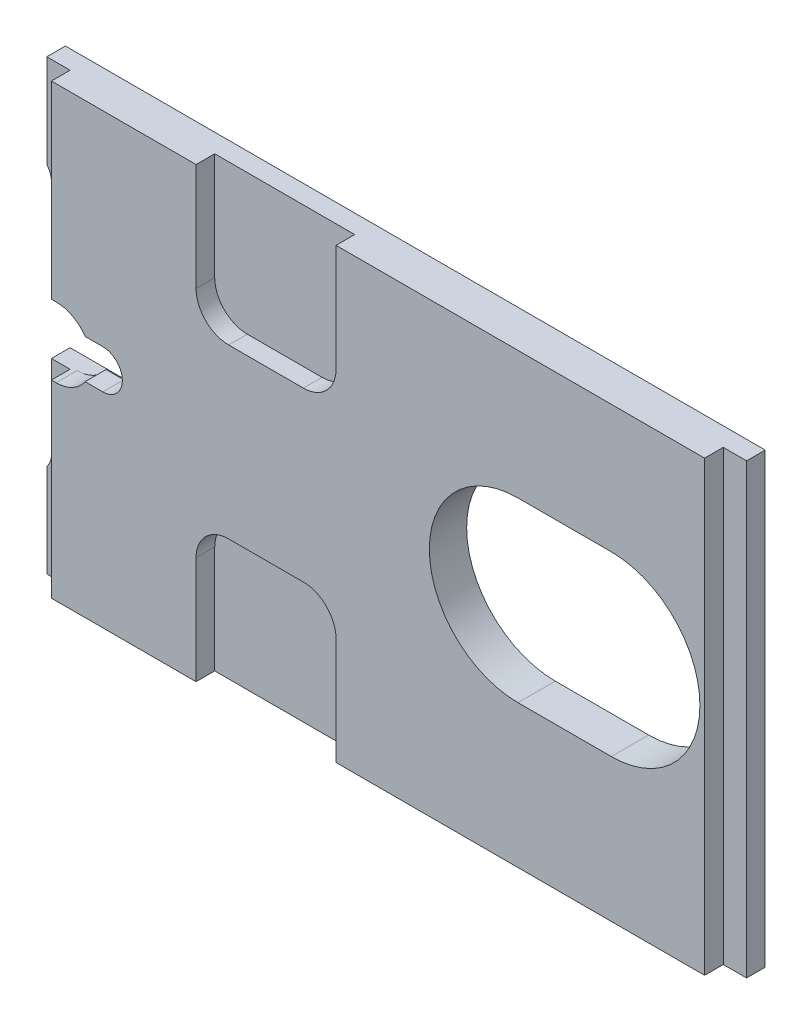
ISO-10303-21;
HEADER;
FILE_DESCRIPTION(('STEP AP214'),'2;1');
FILE_NAME('part.step','',(''),(''),'','','');
FILE_SCHEMA(('AUTOMOTIVE_DESIGN { 1 0 10303 214 1 1 1 1 }'));
ENDSEC;
DATA;
#1=APPLICATION_CONTEXT('core data for automotive mechanical design processes');
#2=APPLICATION_PROTOCOL_DEFINITION('international standard','automotive_design',2000,#1);
#3=PRODUCT_CONTEXT('',#1,'mechanical');
#4=PRODUCT('Part','Part','',(#3));
#5=PRODUCT_RELATED_PRODUCT_CATEGORY('part','',(#4));
#6=PRODUCT_DEFINITION_FORMATION('','',#4);
#7=PRODUCT_DEFINITION_CONTEXT('part definition',#1,'design');
#8=PRODUCT_DEFINITION('design','',#6,#7);
#9=PRODUCT_DEFINITION_SHAPE('','',#8);
#10=(LENGTH_UNIT() NAMED_UNIT(*) SI_UNIT(.MILLI.,.METRE.));
#11=(NAMED_UNIT(*) PLANE_ANGLE_UNIT() SI_UNIT($,.RADIAN.));
#12=(NAMED_UNIT(*) SI_UNIT($,.STERADIAN.) SOLID_ANGLE_UNIT());
#13=UNCERTAINTY_MEASURE_WITH_UNIT(LENGTH_MEASURE(1.E-05),#10,'distance_accuracy_value','');
#14=(GEOMETRIC_REPRESENTATION_CONTEXT(3) GLOBAL_UNCERTAINTY_ASSIGNED_CONTEXT((#13)) GLOBAL_UNIT_ASSIGNED_CONTEXT((#10,
#11,#12)) REPRESENTATION_CONTEXT('',''));
#15=CARTESIAN_POINT('',(0.,0.,0.));
#16=DIRECTION('',(0.,0.,1.));
#17=DIRECTION('',(1.,0.,0.));
#18=AXIS2_PLACEMENT_3D('',#15,#16,#17);
#19=CARTESIAN_POINT('',(-19.,25.354248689,0.));
#20=DIRECTION('',(0.,0.,1.));
#21=DIRECTION('',(1.,0.,0.));
#22=AXIS2_PLACEMENT_3D('',#19,#20,#21);
#23=CYLINDRICAL_SURFACE('',#22,4.);
#24=DIRECTION('',(0.,0.,1.));
#25=VECTOR('',#24,1.);
#26=CARTESIAN_POINT('',(-15.,25.354248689,2.));
#27=LINE('',#26,#25);
#28=CARTESIAN_POINT('',(-14.999999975,25.354248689,0.));
#29=VERTEX_POINT('',#28);
#30=CARTESIAN_POINT('',(-15.,25.354248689,4.));
#31=VERTEX_POINT('',#30);
#32=EDGE_CURVE('E576',#29,#31,#27,.T.);
#33=ORIENTED_EDGE('',*,*,#32,.T.);
#34=CARTESIAN_POINT('',(-19.,25.354248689,4.));
#35=DIRECTION('',(0.,0.,1.));
#36=DIRECTION('',(1.,0.,0.));
#37=AXIS2_PLACEMENT_3D('',#34,#35,#36);
#38=CIRCLE('',#37,4.);
#39=CARTESIAN_POINT('',(-16.,28.0000000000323,4.));
#40=VERTEX_POINT('',#39);
#41=EDGE_CURVE('E332',#31,#40,#38,.T.);
#42=ORIENTED_EDGE('',*,*,#41,.T.);
#43=DIRECTION('',(0.,0.,-1.));
#44=VECTOR('',#43,1.);
#45=CARTESIAN_POINT('',(-16.,28.,2.));
#46=LINE('',#45,#44);
#47=CARTESIAN_POINT('',(-16.,28.0000000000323,0.));
#48=VERTEX_POINT('',#47);
#49=EDGE_CURVE('E319',#40,#48,#46,.T.);
#50=ORIENTED_EDGE('',*,*,#49,.T.);
#51=CARTESIAN_POINT('',(-19.,25.354248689,0.));
#52=DIRECTION('',(0.,0.,1.));
#53=DIRECTION('',(1.,0.,0.));
#54=AXIS2_PLACEMENT_3D('',#51,#52,#53);
#55=CIRCLE('',#54,4.);
#56=EDGE_CURVE('E331',#29,#48,#55,.T.);
#57=ORIENTED_EDGE('',*,*,#56,.F.);
#58=EDGE_LOOP('',(#33,#42,#50,#57));
#59=FACE_BOUND('',#58,.T.);
#60=ADVANCED_FACE('F14',(#59),#23,.F.);
#61=CARTESIAN_POINT('',(-19.,-25.354248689,0.));
#62=DIRECTION('',(0.,0.,1.));
#63=DIRECTION('',(1.,0.,0.));
#64=AXIS2_PLACEMENT_3D('',#61,#62,#63);
#65=CYLINDRICAL_SURFACE('',#64,4.);
#66=DIRECTION('',(0.,0.,1.));
#67=VECTOR('',#66,1.);
#68=CARTESIAN_POINT('',(-16.,-28.,2.));
#69=LINE('',#68,#67);
#70=CARTESIAN_POINT('',(-16.,-28.0000000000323,0.));
#71=VERTEX_POINT('',#70);
#72=CARTESIAN_POINT('',(-16.,-28.0000000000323,4.));
#73=VERTEX_POINT('',#72);
#74=EDGE_CURVE('E326',#71,#73,#69,.T.);
#75=ORIENTED_EDGE('',*,*,#74,.T.);
#76=CARTESIAN_POINT('',(-19.,-25.354248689,4.));
#77=DIRECTION('',(0.,0.,1.));
#78=DIRECTION('',(1.,0.,0.));
#79=AXIS2_PLACEMENT_3D('',#76,#77,#78);
#80=CIRCLE('',#79,4.);
#81=CARTESIAN_POINT('',(-15.,-25.354248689,4.));
#82=VERTEX_POINT('',#81);
#83=EDGE_CURVE('E320',#73,#82,#80,.T.);
#84=ORIENTED_EDGE('',*,*,#83,.T.);
#85=DIRECTION('',(0.,0.,-1.));
#86=VECTOR('',#85,1.);
#87=CARTESIAN_POINT('',(-15.,-25.354248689,2.));
#88=LINE('',#87,#86);
#89=CARTESIAN_POINT('',(-14.999999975,-25.354248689,0.));
#90=VERTEX_POINT('',#89);
#91=EDGE_CURVE('E316',#82,#90,#88,.T.);
#92=ORIENTED_EDGE('',*,*,#91,.T.);
#93=CARTESIAN_POINT('',(-19.,-25.354248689,0.));
#94=DIRECTION('',(0.,0.,1.));
#95=DIRECTION('',(1.,0.,0.));
#96=AXIS2_PLACEMENT_3D('',#93,#94,#95);
#97=CIRCLE('',#96,4.);
#98=EDGE_CURVE('E349',#71,#90,#97,.T.);
#99=ORIENTED_EDGE('',*,*,#98,.F.);
#100=EDGE_LOOP('',(#75,#84,#92,#99));
#101=FACE_BOUND('',#100,.T.);
#102=ADVANCED_FACE('F841',(#101),#65,.F.);
#103=CARTESIAN_POINT('',(-15.,-7.5,4.));
#104=DIRECTION('',(1.,0.,0.));
#105=DIRECTION('',(0.,-1.,0.));
#106=AXIS2_PLACEMENT_3D('',#103,#104,#105);
#107=PLANE('',#106);
#108=ORIENTED_EDGE('',*,*,#91,.F.);
#109=DIRECTION('',(0.,1.,0.));
#110=VECTOR('',#109,1.);
#111=CARTESIAN_POINT('',(-15.,-27.75,4.));
#112=LINE('',#111,#110);
#113=CARTESIAN_POINT('',(-15.,-7.5,4.));
#114=VERTEX_POINT('',#113);
#115=EDGE_CURVE('E317',#82,#114,#112,.T.);
#116=ORIENTED_EDGE('',*,*,#115,.T.);
#117=DIRECTION('',(0.,0.,-1.));
#118=VECTOR('',#117,1.);
#119=CARTESIAN_POINT('',(-15.,-7.5,4.));
#120=LINE('',#119,#118);
#121=CARTESIAN_POINT('',(-14.9999999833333,-7.5,0.));
#122=VERTEX_POINT('',#121);
#123=EDGE_CURVE('E552',#114,#122,#120,.T.);
#124=ORIENTED_EDGE('',*,*,#123,.T.);
#125=DIRECTION('',(0.,1.,0.));
#126=VECTOR('',#125,1.);
#127=CARTESIAN_POINT('',(-14.99999995,0.,0.));
#128=LINE('',#127,#126);
#129=EDGE_CURVE('E344',#90,#122,#128,.T.);
#130=ORIENTED_EDGE('',*,*,#129,.F.);
#131=EDGE_LOOP('',(#108,#116,#124,#130));
#132=FACE_BOUND('',#131,.T.);
#133=ADVANCED_FACE('F838',(#132),#107,.F.);
#134=CARTESIAN_POINT('',(-15.,25.354248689,4.));
#135=DIRECTION('',(1.,0.,0.));
#136=DIRECTION('',(0.,-1.,0.));
#137=AXIS2_PLACEMENT_3D('',#134,#135,#136);
#138=PLANE('',#137);
#139=ORIENTED_EDGE('',*,*,#32,.F.);
#140=DIRECTION('',(0.,1.,0.));
#141=VECTOR('',#140,1.);
#142=CARTESIAN_POINT('',(-14.99999995,0.,0.));
#143=LINE('',#142,#141);
#144=CARTESIAN_POINT('',(-14.9999999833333,7.5,0.));
#145=VERTEX_POINT('',#144);
#146=EDGE_CURVE('E340',#145,#29,#143,.T.);
#147=ORIENTED_EDGE('',*,*,#146,.F.);
#148=DIRECTION('',(0.,0.,1.));
#149=VECTOR('',#148,1.);
#150=CARTESIAN_POINT('',(-15.,7.5,4.));
#151=LINE('',#150,#149);
#152=CARTESIAN_POINT('',(-15.,7.5,4.));
#153=VERTEX_POINT('',#152);
#154=EDGE_CURVE('E526',#145,#153,#151,.T.);
#155=ORIENTED_EDGE('',*,*,#154,.T.);
#156=DIRECTION('',(0.,1.,0.));
#157=VECTOR('',#156,1.);
#158=CARTESIAN_POINT('',(-15.,27.75,4.));
#159=LINE('',#158,#157);
#160=EDGE_CURVE('E335',#153,#31,#159,.T.);
#161=ORIENTED_EDGE('',*,*,#160,.T.);
#162=EDGE_LOOP('',(#139,#147,#155,#161));
#163=FACE_BOUND('',#162,.T.);
#164=ADVANCED_FACE('F745',(#163),#138,.F.);
#165=CARTESIAN_POINT('',(-16.,-48.,4.));
#166=DIRECTION('',(1.,0.,0.));
#167=DIRECTION('',(0.,0.,-1.));
#168=AXIS2_PLACEMENT_3D('',#165,#166,#167);
#169=PLANE('',#168);
#170=ORIENTED_EDGE('',*,*,#74,.F.);
#171=DIRECTION('',(0.,1.,0.));
#172=VECTOR('',#171,1.);
#173=CARTESIAN_POINT('',(-16.,0.,0.));
#174=LINE('',#173,#172);
#175=CARTESIAN_POINT('',(-16.,-48.,0.));
#176=VERTEX_POINT('',#175);
#177=EDGE_CURVE('E352',#176,#71,#174,.T.);
#178=ORIENTED_EDGE('',*,*,#177,.F.);
#179=DIRECTION('',(0.,0.,1.));
#180=VECTOR('',#179,1.);
#181=CARTESIAN_POINT('',(-16.,-48.,4.));
#182=LINE('',#181,#180);
#183=CARTESIAN_POINT('',(-16.,-48.,4.));
#184=VERTEX_POINT('',#183);
#185=EDGE_CURVE('E582',#176,#184,#182,.T.);
#186=ORIENTED_EDGE('',*,*,#185,.T.);
#187=DIRECTION('',(0.,1.,0.));
#188=VECTOR('',#187,1.);
#189=CARTESIAN_POINT('',(-16.,-27.75,4.));
#190=LINE('',#189,#188);
#191=EDGE_CURVE('E323',#184,#73,#190,.T.);
#192=ORIENTED_EDGE('',*,*,#191,.T.);
#193=EDGE_LOOP('',(#170,#178,#186,#192));
#194=FACE_BOUND('',#193,.T.);
#195=ADVANCED_FACE('F845',(#194),#169,.F.);
#196=CARTESIAN_POINT('',(20.,-48.,4.));
#197=DIRECTION('',(0.,0.,-1.));
#198=DIRECTION('',(0.,1.,0.));
#199=AXIS2_PLACEMENT_3D('',#196,#197,#198);
#200=PLANE('',#199);
#201=DIRECTION('',(0.,1.,0.));
#202=VECTOR('',#201,1.);
#203=CARTESIAN_POINT('',(50.,-36.5,4.));
#204=LINE('',#203,#202);
#205=CARTESIAN_POINT('',(49.9999999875,-48.,4.));
#206=VERTEX_POINT('',#205);
#207=CARTESIAN_POINT('',(50.,-24.9999999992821,4.));
#208=VERTEX_POINT('',#207);
#209=EDGE_CURVE('E519',#206,#208,#204,.T.);
#210=ORIENTED_EDGE('',*,*,#209,.T.);
#211=CARTESIAN_POINT('',(43.,-25.,4.));
#212=DIRECTION('',(0.,0.,1.));
#213=DIRECTION('',(1.,0.,0.));
#214=AXIS2_PLACEMENT_3D('',#211,#212,#213);
#215=CIRCLE('',#214,7.);
#216=CARTESIAN_POINT('',(43.,-18.,4.));
#217=VERTEX_POINT('',#216);
#218=EDGE_CURVE('E494',#217,#208,#215,.F.);
#219=ORIENTED_EDGE('',*,*,#218,.F.);
#220=DIRECTION('',(-1.,0.,0.));
#221=VECTOR('',#220,1.);
#222=CARTESIAN_POINT('',(35.,-18.,4.));
#223=LINE('',#222,#221);
#224=CARTESIAN_POINT('',(26.9999999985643,-18.,4.));
#225=VERTEX_POINT('',#224);
#226=EDGE_CURVE('E490',#217,#225,#223,.T.);
#227=ORIENTED_EDGE('',*,*,#226,.T.);
#228=CARTESIAN_POINT('',(27.,-25.,4.));
#229=DIRECTION('',(0.,0.,1.));
#230=DIRECTION('',(1.,0.,0.));
#231=AXIS2_PLACEMENT_3D('',#228,#229,#230);
#232=CIRCLE('',#231,7.);
#233=CARTESIAN_POINT('',(20.,-25.,4.));
#234=VERTEX_POINT('',#233);
#235=EDGE_CURVE('E486',#234,#225,#232,.F.);
#236=ORIENTED_EDGE('',*,*,#235,.F.);
#237=DIRECTION('',(0.,-1.,0.));
#238=VECTOR('',#237,1.);
#239=CARTESIAN_POINT('',(20.,-36.5,4.));
#240=LINE('',#239,#238);
#241=CARTESIAN_POINT('',(20.000000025,-48.,4.));
#242=VERTEX_POINT('',#241);
#243=EDGE_CURVE('E471',#234,#242,#240,.T.);
#244=ORIENTED_EDGE('',*,*,#243,.T.);
#245=DIRECTION('',(1.,0.,0.));
#246=VECTOR('',#245,1.);
#247=CARTESIAN_POINT('',(71.5,-48.,4.));
#248=LINE('',#247,#246);
#249=EDGE_CURVE('E476',#242,#206,#248,.T.);
#250=ORIENTED_EDGE('',*,*,#249,.T.);
#251=EDGE_LOOP('',(#210,#219,#227,#236,#244,#250));
#252=FACE_BOUND('',#251,.T.);
#253=ADVANCED_FACE('F848',(#252),#200,.F.);
#254=CARTESIAN_POINT('',(-16.,-48.,4.));
#255=DIRECTION('',(0.,0.,-1.));
#256=DIRECTION('',(0.,1.,0.));
#257=AXIS2_PLACEMENT_3D('',#254,#255,#256);
#258=PLANE('',#257);
#259=ORIENTED_EDGE('',*,*,#115,.F.);
#260=ORIENTED_EDGE('',*,*,#83,.F.);
#261=ORIENTED_EDGE('',*,*,#191,.F.);
#262=DIRECTION('',(1.,0.,0.));
#263=VECTOR('',#262,1.);
#264=CARTESIAN_POINT('',(71.5,-48.,4.));
#265=LINE('',#264,#263);
#266=CARTESIAN_POINT('',(-10.9999999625,-48.,4.));
#267=VERTEX_POINT('',#266);
#268=EDGE_CURVE('E477',#184,#267,#265,.T.);
#269=ORIENTED_EDGE('',*,*,#268,.T.);
#270=DIRECTION('',(0.,1.,0.));
#271=VECTOR('',#270,1.);
#272=CARTESIAN_POINT('',(-11.,-27.75,4.));
#273=LINE('',#272,#271);
#274=CARTESIAN_POINT('',(-10.9999999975,-7.5,4.));
#275=VERTEX_POINT('',#274);
#276=EDGE_CURVE('E365',#267,#275,#273,.T.);
#277=ORIENTED_EDGE('',*,*,#276,.T.);
#278=DIRECTION('',(-1.,0.,0.));
#279=VECTOR('',#278,1.);
#280=CARTESIAN_POINT('',(-7.5,-7.5,4.));
#281=LINE('',#280,#279);
#282=EDGE_CURVE('E556',#275,#114,#281,.T.);
#283=ORIENTED_EDGE('',*,*,#282,.T.);
#284=EDGE_LOOP('',(#259,#260,#261,#269,#277,#283));
#285=FACE_BOUND('',#284,.T.);
#286=ADVANCED_FACE('F852',(#285),#258,.F.);
#287=CARTESIAN_POINT('',(-16.,28.,4.));
#288=DIRECTION('',(1.,0.,0.));
#289=DIRECTION('',(0.,0.,-1.));
#290=AXIS2_PLACEMENT_3D('',#287,#288,#289);
#291=PLANE('',#290);
#292=ORIENTED_EDGE('',*,*,#49,.F.);
#293=DIRECTION('',(0.,1.,0.));
#294=VECTOR('',#293,1.);
#295=CARTESIAN_POINT('',(-16.,27.75,4.));
#296=LINE('',#295,#294);
#297=CARTESIAN_POINT('',(-16.,48.,4.));
#298=VERTEX_POINT('',#297);
#299=EDGE_CURVE('E329',#40,#298,#296,.T.);
#300=ORIENTED_EDGE('',*,*,#299,.T.);
#301=DIRECTION('',(0.,0.,1.));
#302=VECTOR('',#301,1.);
#303=CARTESIAN_POINT('',(-16.,48.,4.));
#304=LINE('',#303,#302);
#305=CARTESIAN_POINT('',(-16.,48.,0.));
#306=VERTEX_POINT('',#305);
#307=EDGE_CURVE('E509',#306,#298,#304,.T.);
#308=ORIENTED_EDGE('',*,*,#307,.F.);
#309=DIRECTION('',(0.,1.,0.));
#310=VECTOR('',#309,1.);
#311=CARTESIAN_POINT('',(-16.,0.,0.));
#312=LINE('',#311,#310);
#313=EDGE_CURVE('E355',#48,#306,#312,.T.);
#314=ORIENTED_EDGE('',*,*,#313,.F.);
#315=EDGE_LOOP('',(#292,#300,#308,#314));
#316=FACE_BOUND('',#315,.T.);
#317=ADVANCED_FACE('F675',(#316),#291,.F.);
#318=CARTESIAN_POINT('',(-16.,7.5,4.));
#319=DIRECTION('',(0.,0.,-1.));
#320=DIRECTION('',(0.,1.,0.));
#321=AXIS2_PLACEMENT_3D('',#318,#319,#320);
#322=PLANE('',#321);
#323=ORIENTED_EDGE('',*,*,#41,.F.);
#324=ORIENTED_EDGE('',*,*,#160,.F.);
#325=DIRECTION('',(1.,0.,0.));
#326=VECTOR('',#325,1.);
#327=CARTESIAN_POINT('',(-7.5,7.5,4.));
#328=LINE('',#327,#326);
#329=CARTESIAN_POINT('',(-10.9999999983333,7.5,4.));
#330=VERTEX_POINT('',#329);
#331=EDGE_CURVE('E523',#153,#330,#328,.T.);
#332=ORIENTED_EDGE('',*,*,#331,.T.);
#333=DIRECTION('',(0.,1.,0.));
#334=VECTOR('',#333,1.);
#335=CARTESIAN_POINT('',(-11.,27.75,4.));
#336=LINE('',#335,#334);
#337=CARTESIAN_POINT('',(-10.99999995,48.,4.));
#338=VERTEX_POINT('',#337);
#339=EDGE_CURVE('E460',#330,#338,#336,.T.);
#340=ORIENTED_EDGE('',*,*,#339,.T.);
#341=DIRECTION('',(1.,0.,0.));
#342=VECTOR('',#341,1.);
#343=CARTESIAN_POINT('',(71.5,48.,4.));
#344=LINE('',#343,#342);
#345=EDGE_CURVE('E450',#298,#338,#344,.T.);
#346=ORIENTED_EDGE('',*,*,#345,.F.);
#347=ORIENTED_EDGE('',*,*,#299,.F.);
#348=EDGE_LOOP('',(#323,#324,#332,#340,#346,#347));
#349=FACE_BOUND('',#348,.T.);
#350=ADVANCED_FACE('F679',(#349),#322,.F.);
#351=CARTESIAN_POINT('',(20.,48.,4.));
#352=DIRECTION('',(0.,0.,1.));
#353=DIRECTION('',(0.,-1.,0.));
#354=AXIS2_PLACEMENT_3D('',#351,#352,#353);
#355=PLANE('',#354);
#356=DIRECTION('',(1.,0.,0.));
#357=VECTOR('',#356,1.);
#358=CARTESIAN_POINT('',(71.5,48.,4.));
#359=LINE('',#358,#357);
#360=CARTESIAN_POINT('',(20.0000000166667,48.,4.));
#361=VERTEX_POINT('',#360);
#362=CARTESIAN_POINT('',(49.9999999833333,48.,4.));
#363=VERTEX_POINT('',#362);
#364=EDGE_CURVE('E696',#361,#363,#359,.T.);
#365=ORIENTED_EDGE('',*,*,#364,.F.);
#366=DIRECTION('',(0.,-1.,0.));
#367=VECTOR('',#366,1.);
#368=CARTESIAN_POINT('',(20.,36.5,4.));
#369=LINE('',#368,#367);
#370=CARTESIAN_POINT('',(20.,25.0000000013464,4.));
#371=VERTEX_POINT('',#370);
#372=EDGE_CURVE('E437',#361,#371,#369,.T.);
#373=ORIENTED_EDGE('',*,*,#372,.T.);
#374=CARTESIAN_POINT('',(27.,25.,4.));
#375=DIRECTION('',(0.,0.,1.));
#376=DIRECTION('',(1.,0.,0.));
#377=AXIS2_PLACEMENT_3D('',#374,#375,#376);
#378=CIRCLE('',#377,7.);
#379=CARTESIAN_POINT('',(26.9999999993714,18.,4.));
#380=VERTEX_POINT('',#379);
#381=EDGE_CURVE('E433',#380,#371,#378,.F.);
#382=ORIENTED_EDGE('',*,*,#381,.F.);
#383=DIRECTION('',(1.,0.,0.));
#384=VECTOR('',#383,1.);
#385=CARTESIAN_POINT('',(35.,18.,4.));
#386=LINE('',#385,#384);
#387=CARTESIAN_POINT('',(43.,18.,4.));
#388=VERTEX_POINT('',#387);
#389=EDGE_CURVE('E525',#380,#388,#386,.T.);
#390=ORIENTED_EDGE('',*,*,#389,.T.);
#391=CARTESIAN_POINT('',(43.,25.,4.));
#392=DIRECTION('',(0.,0.,1.));
#393=DIRECTION('',(1.,0.,0.));
#394=AXIS2_PLACEMENT_3D('',#391,#392,#393);
#395=CIRCLE('',#394,7.);
#396=CARTESIAN_POINT('',(50.,25.,4.));
#397=VERTEX_POINT('',#396);
#398=EDGE_CURVE('E656',#397,#388,#395,.F.);
#399=ORIENTED_EDGE('',*,*,#398,.F.);
#400=DIRECTION('',(0.,1.,0.));
#401=VECTOR('',#400,1.);
#402=CARTESIAN_POINT('',(50.,36.5,4.));
#403=LINE('',#402,#401);
#404=EDGE_CURVE('E517',#397,#363,#403,.T.);
#405=ORIENTED_EDGE('',*,*,#404,.T.);
#406=EDGE_LOOP('',(#365,#373,#382,#390,#399,#405));
#407=FACE_BOUND('',#406,.T.);
#408=ADVANCED_FACE('F768',(#407),#355,.T.);
#409=CARTESIAN_POINT('',(-16.,-48.,0.));
#410=DIRECTION('',(0.,0.,-1.));
#411=DIRECTION('',(0.,1.,0.));
#412=AXIS2_PLACEMENT_3D('',#409,#410,#411);
#413=PLANE('',#412);
#414=CARTESIAN_POINT('',(109.,1.60748590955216,0.));
#415=DIRECTION('',(0.,0.,-1.));
#416=DIRECTION('',(-1.,0.,0.));
#417=AXIS2_PLACEMENT_3D('',#414,#415,#416);
#418=CIRCLE('',#417,19.);
#419=CARTESIAN_POINT('',(109.,20.6074859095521,0.));
#420=VERTEX_POINT('',#419);
#421=CARTESIAN_POINT('',(109.,-17.3925140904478,0.));
#422=VERTEX_POINT('',#421);
#423=EDGE_CURVE('E29',#420,#422,#418,.T.);
#424=ORIENTED_EDGE('',*,*,#423,.F.);
#425=DIRECTION('',(1.,0.,0.));
#426=VECTOR('',#425,1.);
#427=CARTESIAN_POINT('',(109.,20.6074859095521,0.));
#428=LINE('',#427,#426);
#429=CARTESIAN_POINT('',(89.,20.6074859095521,0.));
#430=VERTEX_POINT('',#429);
#431=EDGE_CURVE('E290',#430,#420,#428,.T.);
#432=ORIENTED_EDGE('',*,*,#431,.F.);
#433=CARTESIAN_POINT('',(89.,1.60748590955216,0.));
#434=DIRECTION('',(0.,0.,-1.));
#435=DIRECTION('',(-1.,0.,0.));
#436=AXIS2_PLACEMENT_3D('',#433,#434,#435);
#437=CIRCLE('',#436,19.);
#438=CARTESIAN_POINT('',(89.,-17.3925140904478,0.));
#439=VERTEX_POINT('',#438);
#440=EDGE_CURVE('E274',#439,#430,#437,.T.);
#441=ORIENTED_EDGE('',*,*,#440,.F.);
#442=DIRECTION('',(-1.,0.,0.));
#443=VECTOR('',#442,1.);
#444=CARTESIAN_POINT('',(89.,-17.3925140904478,0.));
#445=LINE('',#444,#443);
#446=EDGE_CURVE('E283',#422,#439,#445,.T.);
#447=ORIENTED_EDGE('',*,*,#446,.F.);
#448=EDGE_LOOP('',(#424,#432,#441,#447));
#449=FACE_BOUND('',#448,.T.);
#450=DIRECTION('',(0.,-1.,0.));
#451=VECTOR('',#450,1.);
#452=CARTESIAN_POINT('',(134.,48.0001033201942,0.));
#453=LINE('',#452,#451);
#454=CARTESIAN_POINT('',(134.,48.,0.));
#455=VERTEX_POINT('',#454);
#456=CARTESIAN_POINT('',(134.,-48.,0.));
#457=VERTEX_POINT('',#456);
#458=EDGE_CURVE('E308',#455,#457,#453,.T.);
#459=ORIENTED_EDGE('',*,*,#458,.T.);
#460=DIRECTION('',(-1.,0.,0.));
#461=VECTOR('',#460,1.);
#462=CARTESIAN_POINT('',(71.5,-48.,0.));
#463=LINE('',#462,#461);
#464=EDGE_CURVE('E585',#457,#176,#463,.T.);
#465=ORIENTED_EDGE('',*,*,#464,.T.);
#466=ORIENTED_EDGE('',*,*,#177,.T.);
#467=ORIENTED_EDGE('',*,*,#98,.T.);
#468=ORIENTED_EDGE('',*,*,#129,.T.);
#469=DIRECTION('',(1.,0.,0.));
#470=VECTOR('',#469,1.);
#471=CARTESIAN_POINT('',(-7.5,-7.5,0.));
#472=LINE('',#471,#470);
#473=CARTESIAN_POINT('',(-1.53825216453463E-09,-7.5,0.));
#474=VERTEX_POINT('',#473);
#475=EDGE_CURVE('E549',#122,#474,#472,.T.);
#476=ORIENTED_EDGE('',*,*,#475,.T.);
#477=CARTESIAN_POINT('',(0.,0.,0.));
#478=DIRECTION('',(0.,0.,-1.));
#479=DIRECTION('',(-1.,0.,0.));
#480=AXIS2_PLACEMENT_3D('',#477,#478,#479);
#481=CIRCLE('',#480,7.5);
#482=CARTESIAN_POINT('',(0.,7.5,0.));
#483=VERTEX_POINT('',#482);
#484=EDGE_CURVE('E551',#483,#474,#481,.T.);
#485=ORIENTED_EDGE('',*,*,#484,.F.);
#486=DIRECTION('',(-1.,0.,0.));
#487=VECTOR('',#486,1.);
#488=CARTESIAN_POINT('',(-7.5,7.5,0.));
#489=LINE('',#488,#487);
#490=EDGE_CURVE('E541',#483,#145,#489,.T.);
#491=ORIENTED_EDGE('',*,*,#490,.T.);
#492=ORIENTED_EDGE('',*,*,#146,.T.);
#493=ORIENTED_EDGE('',*,*,#56,.T.);
#494=ORIENTED_EDGE('',*,*,#313,.T.);
#495=DIRECTION('',(-1.,0.,0.));
#496=VECTOR('',#495,1.);
#497=CARTESIAN_POINT('',(71.5,48.,0.));
#498=LINE('',#497,#496);
#499=EDGE_CURVE('E506',#455,#306,#498,.T.);
#500=ORIENTED_EDGE('',*,*,#499,.F.);
#501=EDGE_LOOP('',(#459,#465,#466,#467,#468,#476,#485,#491,#492,#493,#494,#500));
#502=FACE_BOUND('',#501,.T.);
#503=ADVANCED_FACE('F287',(#449,#502),#413,.T.);
#504=CARTESIAN_POINT('',(-15.,-7.5,8.));
#505=DIRECTION('',(0.,-1.,0.));
#506=DIRECTION('',(0.,0.,-1.));
#507=AXIS2_PLACEMENT_3D('',#504,#505,#506);
#508=PLANE('',#507);
#509=ORIENTED_EDGE('',*,*,#123,.F.);
#510=ORIENTED_EDGE('',*,*,#282,.F.);
#511=DIRECTION('',(0.,0.,1.));
#512=VECTOR('',#511,1.);
#513=CARTESIAN_POINT('',(-11.,-7.5,6.));
#514=LINE('',#513,#512);
#515=CARTESIAN_POINT('',(-10.9999999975,-7.5,8.));
#516=VERTEX_POINT('',#515);
#517=EDGE_CURVE('E366',#275,#516,#514,.T.);
#518=ORIENTED_EDGE('',*,*,#517,.T.);
#519=DIRECTION('',(-1.,0.,0.));
#520=VECTOR('',#519,1.);
#521=CARTESIAN_POINT('',(-7.5,-7.5,8.));
#522=LINE('',#521,#520);
#523=CARTESIAN_POINT('',(-10.0000000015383,-7.5,8.));
#524=VERTEX_POINT('',#523);
#525=EDGE_CURVE('E343',#524,#516,#522,.T.);
#526=ORIENTED_EDGE('',*,*,#525,.F.);
#527=DIRECTION('',(0.,0.,-1.));
#528=VECTOR('',#527,1.);
#529=CARTESIAN_POINT('',(-10.0000000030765,-7.5,5.75));
#530=LINE('',#529,#528);
#531=CARTESIAN_POINT('',(-10.0000000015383,-7.5,3.5));
#532=VERTEX_POINT('',#531);
#533=EDGE_CURVE('E374',#532,#524,#530,.F.);
#534=ORIENTED_EDGE('',*,*,#533,.F.);
#535=DIRECTION('',(1.,0.,0.));
#536=VECTOR('',#535,1.);
#537=CARTESIAN_POINT('',(-1.25,-7.5,3.5));
#538=LINE('',#537,#536);
#539=CARTESIAN_POINT('',(-1.53825216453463E-09,-7.5,3.5));
#540=VERTEX_POINT('',#539);
#541=EDGE_CURVE('E372',#532,#540,#538,.T.);
#542=ORIENTED_EDGE('',*,*,#541,.T.);
#543=DIRECTION('',(0.,0.,-1.));
#544=VECTOR('',#543,1.);
#545=CARTESIAN_POINT('',(-3.07654943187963E-09,-7.5,1.75));
#546=LINE('',#545,#544);
#547=EDGE_CURVE('E662',#474,#540,#546,.F.);
#548=ORIENTED_EDGE('',*,*,#547,.F.);
#549=ORIENTED_EDGE('',*,*,#475,.F.);
#550=EDGE_LOOP('',(#509,#510,#518,#526,#534,#542,#548,#549));
#551=FACE_BOUND('',#550,.T.);
#552=ADVANCED_FACE('F864',(#551),#508,.F.);
#553=CARTESIAN_POINT('',(0.,0.,3.5));
#554=DIRECTION('',(0.,0.,-1.));
#555=DIRECTION('',(-1.,0.,0.));
#556=AXIS2_PLACEMENT_3D('',#553,#554,#555);
#557=CYLINDRICAL_SURFACE('',#556,7.5);
#558=ORIENTED_EDGE('',*,*,#547,.T.);
#559=CARTESIAN_POINT('',(0.,0.,3.5));
#560=DIRECTION('',(0.,0.,-1.));
#561=DIRECTION('',(-1.,0.,0.));
#562=AXIS2_PLACEMENT_3D('',#559,#560,#561);
#563=CIRCLE('',#562,7.5);
#564=CARTESIAN_POINT('',(0.,7.5,3.5));
#565=VERTEX_POINT('',#564);
#566=EDGE_CURVE('E371',#540,#565,#563,.F.);
#567=ORIENTED_EDGE('',*,*,#566,.T.);
#568=DIRECTION('',(0.,0.,-1.));
#569=VECTOR('',#568,1.);
#570=CARTESIAN_POINT('',(0.,7.5,4.));
#571=LINE('',#570,#569);
#572=EDGE_CURVE('E546',#565,#483,#571,.T.);
#573=ORIENTED_EDGE('',*,*,#572,.T.);
#574=ORIENTED_EDGE('',*,*,#484,.T.);
#575=EDGE_LOOP('',(#558,#567,#573,#574));
#576=FACE_BOUND('',#575,.T.);
#577=ADVANCED_FACE('F786',(#576),#557,.F.);
#578=CARTESIAN_POINT('',(-15.,7.5,0.));
#579=DIRECTION('',(0.,1.,0.));
#580=DIRECTION('',(0.,0.,1.));
#581=AXIS2_PLACEMENT_3D('',#578,#579,#580);
#582=PLANE('',#581);
#583=ORIENTED_EDGE('',*,*,#154,.F.);
#584=ORIENTED_EDGE('',*,*,#490,.F.);
#585=ORIENTED_EDGE('',*,*,#572,.F.);
#586=DIRECTION('',(-1.,0.,0.));
#587=VECTOR('',#586,1.);
#588=CARTESIAN_POINT('',(-1.25,7.5,3.5));
#589=LINE('',#588,#587);
#590=CARTESIAN_POINT('',(-10.,7.5,3.5));
#591=VERTEX_POINT('',#590);
#592=EDGE_CURVE('E367',#565,#591,#589,.T.);
#593=ORIENTED_EDGE('',*,*,#592,.T.);
#594=DIRECTION('',(0.,0.,1.));
#595=VECTOR('',#594,1.);
#596=CARTESIAN_POINT('',(-10.,7.5,5.75));
#597=LINE('',#596,#595);
#598=CARTESIAN_POINT('',(-10.,7.5,8.));
#599=VERTEX_POINT('',#598);
#600=EDGE_CURVE('E463',#599,#591,#597,.F.);
#601=ORIENTED_EDGE('',*,*,#600,.F.);
#602=DIRECTION('',(1.,0.,0.));
#603=VECTOR('',#602,1.);
#604=CARTESIAN_POINT('',(-7.5,7.5,8.));
#605=LINE('',#604,#603);
#606=CARTESIAN_POINT('',(-10.9999999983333,7.5,8.));
#607=VERTEX_POINT('',#606);
#608=EDGE_CURVE('E636',#607,#599,#605,.T.);
#609=ORIENTED_EDGE('',*,*,#608,.F.);
#610=DIRECTION('',(0.,0.,-1.));
#611=VECTOR('',#610,1.);
#612=CARTESIAN_POINT('',(-11.,7.5,6.));
#613=LINE('',#612,#611);
#614=EDGE_CURVE('E457',#607,#330,#613,.T.);
#615=ORIENTED_EDGE('',*,*,#614,.T.);
#616=ORIENTED_EDGE('',*,*,#331,.F.);
#617=EDGE_LOOP('',(#583,#584,#585,#593,#601,#609,#615,#616));
#618=FACE_BOUND('',#617,.T.);
#619=ADVANCED_FACE('F749',(#618),#582,.F.);
#620=CARTESIAN_POINT('',(27.,18.,8.));
#621=DIRECTION('',(0.,-1.,0.));
#622=DIRECTION('',(0.,0.,-1.));
#623=AXIS2_PLACEMENT_3D('',#620,#621,#622);
#624=PLANE('',#623);
#625=DIRECTION('',(0.,0.,-1.));
#626=VECTOR('',#625,1.);
#627=CARTESIAN_POINT('',(43.,18.,6.));
#628=LINE('',#627,#626);
#629=CARTESIAN_POINT('',(43.,18.,8.));
#630=VERTEX_POINT('',#629);
#631=EDGE_CURVE('E659',#388,#630,#628,.F.);
#632=ORIENTED_EDGE('',*,*,#631,.F.);
#633=ORIENTED_EDGE('',*,*,#389,.F.);
#634=DIRECTION('',(0.,0.,1.));
#635=VECTOR('',#634,1.);
#636=CARTESIAN_POINT('',(26.9999999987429,18.,6.));
#637=LINE('',#636,#635);
#638=CARTESIAN_POINT('',(26.9999999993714,18.,8.));
#639=VERTEX_POINT('',#638);
#640=EDGE_CURVE('E434',#639,#380,#637,.F.);
#641=ORIENTED_EDGE('',*,*,#640,.F.);
#642=DIRECTION('',(1.,0.,0.));
#643=VECTOR('',#642,1.);
#644=CARTESIAN_POINT('',(71.5,18.,8.));
#645=LINE('',#644,#643);
#646=EDGE_CURVE('E401',#639,#630,#645,.T.);
#647=ORIENTED_EDGE('',*,*,#646,.T.);
#648=EDGE_LOOP('',(#632,#633,#641,#647));
#649=FACE_BOUND('',#648,.T.);
#650=ADVANCED_FACE('F777',(#649),#624,.F.);
#651=CARTESIAN_POINT('',(43.,25.,4.));
#652=DIRECTION('',(0.,0.,1.));
#653=DIRECTION('',(1.,0.,0.));
#654=AXIS2_PLACEMENT_3D('',#651,#652,#653);
#655=CYLINDRICAL_SURFACE('',#654,7.);
#656=ORIENTED_EDGE('',*,*,#398,.T.);
#657=ORIENTED_EDGE('',*,*,#631,.T.);
#658=CARTESIAN_POINT('',(43.,25.,8.));
#659=DIRECTION('',(0.,0.,1.));
#660=DIRECTION('',(1.,0.,0.));
#661=AXIS2_PLACEMENT_3D('',#658,#659,#660);
#662=CIRCLE('',#661,7.);
#663=CARTESIAN_POINT('',(50.000000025,25.,8.));
#664=VERTEX_POINT('',#663);
#665=EDGE_CURVE('E398',#630,#664,#662,.T.);
#666=ORIENTED_EDGE('',*,*,#665,.T.);
#667=DIRECTION('',(0.,0.,-1.));
#668=VECTOR('',#667,1.);
#669=CARTESIAN_POINT('',(50.,25.,6.));
#670=LINE('',#669,#668);
#671=EDGE_CURVE('E520',#664,#397,#670,.T.);
#672=ORIENTED_EDGE('',*,*,#671,.T.);
#673=EDGE_LOOP('',(#656,#657,#666,#672));
#674=FACE_BOUND('',#673,.T.);
#675=ADVANCED_FACE('F775',(#674),#655,.F.);
#676=CARTESIAN_POINT('',(50.,48.,8.));
#677=DIRECTION('',(1.,0.,0.));
#678=DIRECTION('',(0.,-1.,0.));
#679=AXIS2_PLACEMENT_3D('',#676,#677,#678);
#680=PLANE('',#679);
#681=DIRECTION('',(0.,0.,1.));
#682=VECTOR('',#681,1.);
#683=CARTESIAN_POINT('',(49.999999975,48.,4.));
#684=LINE('',#683,#682);
#685=CARTESIAN_POINT('',(50.000000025,48.,8.));
#686=VERTEX_POINT('',#685);
#687=EDGE_CURVE('E510',#363,#686,#684,.T.);
#688=ORIENTED_EDGE('',*,*,#687,.F.);
#689=ORIENTED_EDGE('',*,*,#404,.F.);
#690=ORIENTED_EDGE('',*,*,#671,.F.);
#691=DIRECTION('',(0.,1.,0.));
#692=VECTOR('',#691,1.);
#693=CARTESIAN_POINT('',(50.00000005,0.,8.));
#694=LINE('',#693,#692);
#695=EDGE_CURVE('E395',#664,#686,#694,.T.);
#696=ORIENTED_EDGE('',*,*,#695,.T.);
#697=EDGE_LOOP('',(#688,#689,#690,#696));
#698=FACE_BOUND('',#697,.T.);
#699=ADVANCED_FACE('F773',(#698),#680,.F.);
#700=CARTESIAN_POINT('',(50.,-25.,8.));
#701=DIRECTION('',(1.,0.,0.));
#702=DIRECTION('',(0.,-1.,0.));
#703=AXIS2_PLACEMENT_3D('',#700,#701,#702);
#704=PLANE('',#703);
#705=DIRECTION('',(0.,0.,-1.));
#706=VECTOR('',#705,1.);
#707=CARTESIAN_POINT('',(50.,-24.9999999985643,6.));
#708=LINE('',#707,#706);
#709=CARTESIAN_POINT('',(50.000000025,-24.9999999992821,8.));
#710=VERTEX_POINT('',#709);
#711=EDGE_CURVE('E491',#208,#710,#708,.F.);
#712=ORIENTED_EDGE('',*,*,#711,.F.);
#713=ORIENTED_EDGE('',*,*,#209,.F.);
#714=DIRECTION('',(0.,0.,1.));
#715=VECTOR('',#714,1.);
#716=CARTESIAN_POINT('',(49.999999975,-48.,4.));
#717=LINE('',#716,#715);
#718=CARTESIAN_POINT('',(50.000000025,-48.,8.));
#719=VERTEX_POINT('',#718);
#720=EDGE_CURVE('E497',#206,#719,#717,.T.);
#721=ORIENTED_EDGE('',*,*,#720,.T.);
#722=DIRECTION('',(0.,1.,0.));
#723=VECTOR('',#722,1.);
#724=CARTESIAN_POINT('',(50.00000005,0.,8.));
#725=LINE('',#724,#723);
#726=EDGE_CURVE('E390',#719,#710,#725,.T.);
#727=ORIENTED_EDGE('',*,*,#726,.T.);
#728=EDGE_LOOP('',(#712,#713,#721,#727));
#729=FACE_BOUND('',#728,.T.);
#730=ADVANCED_FACE('F792',(#729),#704,.F.);
#731=CARTESIAN_POINT('',(43.,-25.,4.));
#732=DIRECTION('',(0.,0.,1.));
#733=DIRECTION('',(1.,0.,0.));
#734=AXIS2_PLACEMENT_3D('',#731,#732,#733);
#735=CYLINDRICAL_SURFACE('',#734,7.);
#736=ORIENTED_EDGE('',*,*,#218,.T.);
#737=ORIENTED_EDGE('',*,*,#711,.T.);
#738=CARTESIAN_POINT('',(43.,-25.,8.));
#739=DIRECTION('',(0.,0.,1.));
#740=DIRECTION('',(1.,0.,0.));
#741=AXIS2_PLACEMENT_3D('',#738,#739,#740);
#742=CIRCLE('',#741,7.);
#743=CARTESIAN_POINT('',(43.,-18.,8.));
#744=VERTEX_POINT('',#743);
#745=EDGE_CURVE('E389',#710,#744,#742,.T.);
#746=ORIENTED_EDGE('',*,*,#745,.T.);
#747=DIRECTION('',(0.,0.,-1.));
#748=VECTOR('',#747,1.);
#749=CARTESIAN_POINT('',(43.,-18.,6.));
#750=LINE('',#749,#748);
#751=EDGE_CURVE('E487',#744,#217,#750,.T.);
#752=ORIENTED_EDGE('',*,*,#751,.T.);
#753=EDGE_LOOP('',(#736,#737,#746,#752));
#754=FACE_BOUND('',#753,.T.);
#755=ADVANCED_FACE('F795',(#754),#735,.F.);
#756=CARTESIAN_POINT('',(27.,-18.,4.));
#757=DIRECTION('',(0.,1.,0.));
#758=DIRECTION('',(0.,0.,1.));
#759=AXIS2_PLACEMENT_3D('',#756,#757,#758);
#760=PLANE('',#759);
#761=DIRECTION('',(0.,0.,-1.));
#762=VECTOR('',#761,1.);
#763=CARTESIAN_POINT('',(26.9999999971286,-18.,6.));
#764=LINE('',#763,#762);
#765=CARTESIAN_POINT('',(26.9999999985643,-18.,8.));
#766=VERTEX_POINT('',#765);
#767=EDGE_CURVE('E472',#225,#766,#764,.F.);
#768=ORIENTED_EDGE('',*,*,#767,.F.);
#769=ORIENTED_EDGE('',*,*,#226,.F.);
#770=ORIENTED_EDGE('',*,*,#751,.F.);
#771=DIRECTION('',(-1.,0.,0.));
#772=VECTOR('',#771,1.);
#773=CARTESIAN_POINT('',(71.5,-18.,8.));
#774=LINE('',#773,#772);
#775=EDGE_CURVE('E387',#744,#766,#774,.T.);
#776=ORIENTED_EDGE('',*,*,#775,.T.);
#777=EDGE_LOOP('',(#768,#769,#770,#776));
#778=FACE_BOUND('',#777,.T.);
#779=ADVANCED_FACE('F797',(#778),#760,.F.);
#780=CARTESIAN_POINT('',(27.,-25.,4.));
#781=DIRECTION('',(0.,0.,1.));
#782=DIRECTION('',(1.,0.,0.));
#783=AXIS2_PLACEMENT_3D('',#780,#781,#782);
#784=CYLINDRICAL_SURFACE('',#783,7.);
#785=ORIENTED_EDGE('',*,*,#235,.T.);
#786=ORIENTED_EDGE('',*,*,#767,.T.);
#787=CARTESIAN_POINT('',(27.,-25.,8.));
#788=DIRECTION('',(0.,0.,1.));
#789=DIRECTION('',(1.,0.,0.));
#790=AXIS2_PLACEMENT_3D('',#787,#788,#789);
#791=CIRCLE('',#790,7.);
#792=CARTESIAN_POINT('',(20.00000001,-25.,8.));
#793=VERTEX_POINT('',#792);
#794=EDGE_CURVE('E384',#766,#793,#791,.T.);
#795=ORIENTED_EDGE('',*,*,#794,.T.);
#796=DIRECTION('',(0.,0.,-1.));
#797=VECTOR('',#796,1.);
#798=CARTESIAN_POINT('',(20.,-25.,6.));
#799=LINE('',#798,#797);
#800=EDGE_CURVE('E468',#793,#234,#799,.T.);
#801=ORIENTED_EDGE('',*,*,#800,.T.);
#802=EDGE_LOOP('',(#785,#786,#795,#801));
#803=FACE_BOUND('',#802,.T.);
#804=ADVANCED_FACE('F800',(#803),#784,.F.);
#805=CARTESIAN_POINT('',(20.,-48.,4.));
#806=DIRECTION('',(-1.,0.,0.));
#807=DIRECTION('',(0.,0.,1.));
#808=AXIS2_PLACEMENT_3D('',#805,#806,#807);
#809=PLANE('',#808);
#810=DIRECTION('',(0.,0.,-1.));
#811=VECTOR('',#810,1.);
#812=CARTESIAN_POINT('',(20.00000005,-48.,4.));
#813=LINE('',#812,#811);
#814=CARTESIAN_POINT('',(20.00000003,-48.,8.));
#815=VERTEX_POINT('',#814);
#816=EDGE_CURVE('E473',#815,#242,#813,.T.);
#817=ORIENTED_EDGE('',*,*,#816,.T.);
#818=ORIENTED_EDGE('',*,*,#243,.F.);
#819=ORIENTED_EDGE('',*,*,#800,.F.);
#820=DIRECTION('',(0.,-1.,0.));
#821=VECTOR('',#820,1.);
#822=CARTESIAN_POINT('',(20.00000002,0.,8.));
#823=LINE('',#822,#821);
#824=EDGE_CURVE('E381',#793,#815,#823,.T.);
#825=ORIENTED_EDGE('',*,*,#824,.T.);
#826=EDGE_LOOP('',(#817,#818,#819,#825));
#827=FACE_BOUND('',#826,.T.);
#828=ADVANCED_FACE('F802',(#827),#809,.F.);
#829=CARTESIAN_POINT('',(-16.,-48.,0.));
#830=DIRECTION('',(0.,1.,0.));
#831=DIRECTION('',(0.,0.,1.));
#832=AXIS2_PLACEMENT_3D('',#829,#830,#831);
#833=PLANE('',#832);
#834=DIRECTION('',(1.,0.,0.));
#835=VECTOR('',#834,1.);
#836=CARTESIAN_POINT('',(134.,-48.,4.));
#837=LINE('',#836,#835);
#838=CARTESIAN_POINT('',(129.,-48.,4.));
#839=VERTEX_POINT('',#838);
#840=CARTESIAN_POINT('',(134.,-48.,4.));
#841=VERTEX_POINT('',#840);
#842=EDGE_CURVE('E302',#839,#841,#837,.T.);
#843=ORIENTED_EDGE('',*,*,#842,.F.);
#844=DIRECTION('',(0.,0.,-1.));
#845=VECTOR('',#844,1.);
#846=CARTESIAN_POINT('',(129.,-48.,4.));
#847=LINE('',#846,#845);
#848=CARTESIAN_POINT('',(129.,-48.,8.));
#849=VERTEX_POINT('',#848);
#850=EDGE_CURVE('E297',#849,#839,#847,.T.);
#851=ORIENTED_EDGE('',*,*,#850,.F.);
#852=DIRECTION('',(-1.,0.,0.));
#853=VECTOR('',#852,1.);
#854=CARTESIAN_POINT('',(71.5,-48.,8.));
#855=LINE('',#854,#853);
#856=EDGE_CURVE('E392',#849,#719,#855,.T.);
#857=ORIENTED_EDGE('',*,*,#856,.T.);
#858=ORIENTED_EDGE('',*,*,#720,.F.);
#859=ORIENTED_EDGE('',*,*,#249,.F.);
#860=ORIENTED_EDGE('',*,*,#816,.F.);
#861=DIRECTION('',(-1.,0.,0.));
#862=VECTOR('',#861,1.);
#863=CARTESIAN_POINT('',(71.5,-48.,8.));
#864=LINE('',#863,#862);
#865=CARTESIAN_POINT('',(-10.9999999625,-48.,8.));
#866=VERTEX_POINT('',#865);
#867=EDGE_CURVE('E383',#815,#866,#864,.T.);
#868=ORIENTED_EDGE('',*,*,#867,.T.);
#869=DIRECTION('',(0.,0.,-1.));
#870=VECTOR('',#869,1.);
#871=CARTESIAN_POINT('',(-11.,-48.,6.));
#872=LINE('',#871,#870);
#873=EDGE_CURVE('E362',#866,#267,#872,.T.);
#874=ORIENTED_EDGE('',*,*,#873,.T.);
#875=ORIENTED_EDGE('',*,*,#268,.F.);
#876=ORIENTED_EDGE('',*,*,#185,.F.);
#877=ORIENTED_EDGE('',*,*,#464,.F.);
#878=DIRECTION('',(0.,0.,-1.));
#879=VECTOR('',#878,1.);
#880=CARTESIAN_POINT('',(134.,-48.,0.));
#881=LINE('',#880,#879);
#882=EDGE_CURVE('E305',#841,#457,#881,.T.);
#883=ORIENTED_EDGE('',*,*,#882,.F.);
#884=EDGE_LOOP('',(#843,#851,#857,#858,#859,#860,#868,#874,#875,#876,#877,#883));
#885=FACE_BOUND('',#884,.T.);
#886=ADVANCED_FACE('F737',(#885),#833,.F.);
#887=CARTESIAN_POINT('',(-11.,-48.,8.));
#888=DIRECTION('',(1.,0.,0.));
#889=DIRECTION('',(0.,0.,-1.));
#890=AXIS2_PLACEMENT_3D('',#887,#888,#889);
#891=PLANE('',#890);
#892=ORIENTED_EDGE('',*,*,#873,.F.);
#893=DIRECTION('',(0.,1.,0.));
#894=VECTOR('',#893,1.);
#895=CARTESIAN_POINT('',(-11.,0.,8.));
#896=LINE('',#895,#894);
#897=EDGE_CURVE('E481',#866,#516,#896,.T.);
#898=ORIENTED_EDGE('',*,*,#897,.T.);
#899=ORIENTED_EDGE('',*,*,#517,.F.);
#900=ORIENTED_EDGE('',*,*,#276,.F.);
#901=EDGE_LOOP('',(#892,#898,#899,#900));
#902=FACE_BOUND('',#901,.T.);
#903=ADVANCED_FACE('F808',(#902),#891,.F.);
#904=CARTESIAN_POINT('',(-11.,7.5,8.));
#905=DIRECTION('',(1.,0.,0.));
#906=DIRECTION('',(0.,0.,-1.));
#907=AXIS2_PLACEMENT_3D('',#904,#905,#906);
#908=PLANE('',#907);
#909=DIRECTION('',(0.,0.,1.));
#910=VECTOR('',#909,1.);
#911=CARTESIAN_POINT('',(-10.999999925,48.,4.));
#912=LINE('',#911,#910);
#913=CARTESIAN_POINT('',(-10.999999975,48.,8.));
#914=VERTEX_POINT('',#913);
#915=EDGE_CURVE('E441',#338,#914,#912,.T.);
#916=ORIENTED_EDGE('',*,*,#915,.F.);
#917=ORIENTED_EDGE('',*,*,#339,.F.);
#918=ORIENTED_EDGE('',*,*,#614,.F.);
#919=DIRECTION('',(0.,1.,0.));
#920=VECTOR('',#919,1.);
#921=CARTESIAN_POINT('',(-11.,0.,8.));
#922=LINE('',#921,#920);
#923=EDGE_CURVE('E445',#607,#914,#922,.T.);
#924=ORIENTED_EDGE('',*,*,#923,.T.);
#925=EDGE_LOOP('',(#916,#917,#918,#924));
#926=FACE_BOUND('',#925,.T.);
#927=ADVANCED_FACE('F753',(#926),#908,.F.);
#928=CARTESIAN_POINT('',(-16.,48.,0.));
#929=DIRECTION('',(0.,1.,0.));
#930=DIRECTION('',(0.,0.,1.));
#931=AXIS2_PLACEMENT_3D('',#928,#929,#930);
#932=PLANE('',#931);
#933=DIRECTION('',(0.,0.,1.));
#934=VECTOR('',#933,1.);
#935=CARTESIAN_POINT('',(129.,48.,0.));
#936=LINE('',#935,#934);
#937=CARTESIAN_POINT('',(129.,48.,4.));
#938=VERTEX_POINT('',#937);
#939=CARTESIAN_POINT('',(129.,48.,8.));
#940=VERTEX_POINT('',#939);
#941=EDGE_CURVE('E311',#938,#940,#936,.T.);
#942=ORIENTED_EDGE('',*,*,#941,.F.);
#943=DIRECTION('',(-1.,0.,0.));
#944=VECTOR('',#943,1.);
#945=CARTESIAN_POINT('',(-16.,48.,4.));
#946=LINE('',#945,#944);
#947=CARTESIAN_POINT('',(134.,48.,4.));
#948=VERTEX_POINT('',#947);
#949=EDGE_CURVE('E505',#948,#938,#946,.T.);
#950=ORIENTED_EDGE('',*,*,#949,.F.);
#951=DIRECTION('',(0.,0.,1.));
#952=VECTOR('',#951,1.);
#953=CARTESIAN_POINT('',(134.,48.,0.));
#954=LINE('',#953,#952);
#955=EDGE_CURVE('E587',#455,#948,#954,.T.);
#956=ORIENTED_EDGE('',*,*,#955,.F.);
#957=ORIENTED_EDGE('',*,*,#499,.T.);
#958=ORIENTED_EDGE('',*,*,#307,.T.);
#959=ORIENTED_EDGE('',*,*,#345,.T.);
#960=ORIENTED_EDGE('',*,*,#915,.T.);
#961=DIRECTION('',(1.,0.,0.));
#962=VECTOR('',#961,1.);
#963=CARTESIAN_POINT('',(71.5,48.,8.));
#964=LINE('',#963,#962);
#965=CARTESIAN_POINT('',(20.0000000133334,48.,8.));
#966=VERTEX_POINT('',#965);
#967=EDGE_CURVE('E378',#914,#966,#964,.T.);
#968=ORIENTED_EDGE('',*,*,#967,.T.);
#969=DIRECTION('',(0.,0.,-1.));
#970=VECTOR('',#969,1.);
#971=CARTESIAN_POINT('',(20.,48.,6.));
#972=LINE('',#971,#970);
#973=EDGE_CURVE('E438',#966,#361,#972,.T.);
#974=ORIENTED_EDGE('',*,*,#973,.T.);
#975=ORIENTED_EDGE('',*,*,#364,.T.);
#976=ORIENTED_EDGE('',*,*,#687,.T.);
#977=DIRECTION('',(1.,0.,0.));
#978=VECTOR('',#977,1.);
#979=CARTESIAN_POINT('',(71.5,48.,8.));
#980=LINE('',#979,#978);
#981=EDGE_CURVE('E397',#686,#940,#980,.T.);
#982=ORIENTED_EDGE('',*,*,#981,.T.);
#983=EDGE_LOOP('',(#942,#950,#956,#957,#958,#959,#960,#968,#974,#975,#976,#982));
#984=FACE_BOUND('',#983,.T.);
#985=ADVANCED_FACE('F687',(#984),#932,.T.);
#986=CARTESIAN_POINT('',(20.,25.,4.));
#987=DIRECTION('',(-1.,0.,0.));
#988=DIRECTION('',(0.,0.,1.));
#989=AXIS2_PLACEMENT_3D('',#986,#987,#988);
#990=PLANE('',#989);
#991=DIRECTION('',(0.,0.,-1.));
#992=VECTOR('',#991,1.);
#993=CARTESIAN_POINT('',(20.,25.0000000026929,6.));
#994=LINE('',#993,#992);
#995=CARTESIAN_POINT('',(20.00000001,25.0000000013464,8.));
#996=VERTEX_POINT('',#995);
#997=EDGE_CURVE('E430',#371,#996,#994,.F.);
#998=ORIENTED_EDGE('',*,*,#997,.F.);
#999=ORIENTED_EDGE('',*,*,#372,.F.);
#1000=ORIENTED_EDGE('',*,*,#973,.F.);
#1001=DIRECTION('',(0.,-1.,0.));
#1002=VECTOR('',#1001,1.);
#1003=CARTESIAN_POINT('',(20.00000002,0.,8.));
#1004=LINE('',#1003,#1002);
#1005=EDGE_CURVE('E375',#966,#996,#1004,.T.);
#1006=ORIENTED_EDGE('',*,*,#1005,.T.);
#1007=EDGE_LOOP('',(#998,#999,#1000,#1006));
#1008=FACE_BOUND('',#1007,.T.);
#1009=ADVANCED_FACE('F762',(#1008),#990,.F.);
#1010=CARTESIAN_POINT('',(27.,25.,4.));
#1011=DIRECTION('',(0.,0.,1.));
#1012=DIRECTION('',(1.,0.,0.));
#1013=AXIS2_PLACEMENT_3D('',#1010,#1011,#1012);
#1014=CYLINDRICAL_SURFACE('',#1013,7.);
#1015=ORIENTED_EDGE('',*,*,#381,.T.);
#1016=ORIENTED_EDGE('',*,*,#997,.T.);
#1017=CARTESIAN_POINT('',(27.,25.,8.));
#1018=DIRECTION('',(0.,0.,1.));
#1019=DIRECTION('',(1.,0.,0.));
#1020=AXIS2_PLACEMENT_3D('',#1017,#1018,#1019);
#1021=CIRCLE('',#1020,7.);
#1022=EDGE_CURVE('E377',#996,#639,#1021,.T.);
#1023=ORIENTED_EDGE('',*,*,#1022,.T.);
#1024=ORIENTED_EDGE('',*,*,#640,.T.);
#1025=EDGE_LOOP('',(#1015,#1016,#1023,#1024));
#1026=FACE_BOUND('',#1025,.T.);
#1027=ADVANCED_FACE('F765',(#1026),#1014,.F.);
#1028=CARTESIAN_POINT('',(-10.,0.,8.));
#1029=DIRECTION('',(0.,0.,-1.));
#1030=DIRECTION('',(-1.,0.,0.));
#1031=AXIS2_PLACEMENT_3D('',#1028,#1029,#1030);
#1032=CYLINDRICAL_SURFACE('',#1031,7.5);
#1033=DIRECTION('',(0.,0.,-1.));
#1034=VECTOR('',#1033,1.);
#1035=CARTESIAN_POINT('',(-3.786305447,-4.2,5.75));
#1036=LINE('',#1035,#1034);
#1037=CARTESIAN_POINT('',(-3.7863054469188,-4.2,8.));
#1038=VERTEX_POINT('',#1037);
#1039=CARTESIAN_POINT('',(-3.7863054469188,-4.2,3.5));
#1040=VERTEX_POINT('',#1039);
#1041=EDGE_CURVE('E418',#1038,#1040,#1036,.T.);
#1042=ORIENTED_EDGE('',*,*,#1041,.T.);
#1043=CARTESIAN_POINT('',(-10.,0.,3.5));
#1044=DIRECTION('',(0.,0.,-1.));
#1045=DIRECTION('',(-1.,0.,0.));
#1046=AXIS2_PLACEMENT_3D('',#1043,#1044,#1045);
#1047=CIRCLE('',#1046,7.5);
#1048=EDGE_CURVE('E370',#1040,#532,#1047,.T.);
#1049=ORIENTED_EDGE('',*,*,#1048,.T.);
#1050=ORIENTED_EDGE('',*,*,#533,.T.);
#1051=CARTESIAN_POINT('',(-10.,0.,8.));
#1052=DIRECTION('',(0.,0.,-1.));
#1053=DIRECTION('',(-1.,0.,0.));
#1054=AXIS2_PLACEMENT_3D('',#1051,#1052,#1053);
#1055=CIRCLE('',#1054,7.5);
#1056=EDGE_CURVE('E573',#524,#1038,#1055,.F.);
#1057=ORIENTED_EDGE('',*,*,#1056,.T.);
#1058=EDGE_LOOP('',(#1042,#1049,#1050,#1057));
#1059=FACE_BOUND('',#1058,.T.);
#1060=ADVANCED_FACE('F821',(#1059),#1032,.F.);
#1061=CARTESIAN_POINT('',(-10.105,7.5,3.5));
#1062=DIRECTION('',(0.,0.,1.));
#1063=DIRECTION('',(0.,-1.,0.));
#1064=AXIS2_PLACEMENT_3D('',#1061,#1062,#1063);
#1065=PLANE('',#1064);
#1066=ORIENTED_EDGE('',*,*,#1048,.F.);
#1067=DIRECTION('',(-1.,0.,0.));
#1068=VECTOR('',#1067,1.);
#1069=CARTESIAN_POINT('',(-1.15,-4.19999999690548,3.5));
#1070=LINE('',#1069,#1068);
#1071=CARTESIAN_POINT('',(0.,-4.2,3.5));
#1072=VERTEX_POINT('',#1071);
#1073=EDGE_CURVE('E408',#1072,#1040,#1070,.T.);
#1074=ORIENTED_EDGE('',*,*,#1073,.F.);
#1075=CARTESIAN_POINT('',(0.,0.,3.5));
#1076=DIRECTION('',(0.,0.,-1.));
#1077=DIRECTION('',(-1.,0.,0.));
#1078=AXIS2_PLACEMENT_3D('',#1075,#1076,#1077);
#1079=CIRCLE('',#1078,4.2);
#1080=CARTESIAN_POINT('',(0.,4.19999999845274,3.5));
#1081=VERTEX_POINT('',#1080);
#1082=EDGE_CURVE('E411',#1081,#1072,#1079,.T.);
#1083=ORIENTED_EDGE('',*,*,#1082,.F.);
#1084=DIRECTION('',(1.,0.,0.));
#1085=VECTOR('',#1084,1.);
#1086=CARTESIAN_POINT('',(-1.15,4.19999999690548,3.5));
#1087=LINE('',#1086,#1085);
#1088=CARTESIAN_POINT('',(-3.7863054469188,4.2,3.5));
#1089=VERTEX_POINT('',#1088);
#1090=EDGE_CURVE('E404',#1089,#1081,#1087,.T.);
#1091=ORIENTED_EDGE('',*,*,#1090,.F.);
#1092=CARTESIAN_POINT('',(-10.,0.,3.5));
#1093=DIRECTION('',(0.,0.,-1.));
#1094=DIRECTION('',(-1.,0.,0.));
#1095=AXIS2_PLACEMENT_3D('',#1092,#1093,#1094);
#1096=CIRCLE('',#1095,7.5);
#1097=EDGE_CURVE('E403',#591,#1089,#1096,.T.);
#1098=ORIENTED_EDGE('',*,*,#1097,.F.);
#1099=ORIENTED_EDGE('',*,*,#592,.F.);
#1100=ORIENTED_EDGE('',*,*,#566,.F.);
#1101=ORIENTED_EDGE('',*,*,#541,.F.);
#1102=EDGE_LOOP('',(#1066,#1074,#1083,#1091,#1098,#1099,#1100,#1101));
#1103=FACE_BOUND('',#1102,.T.);
#1104=ADVANCED_FACE('F818',(#1103),#1065,.F.);
#1105=CARTESIAN_POINT('',(-10.,0.,8.));
#1106=DIRECTION('',(0.,0.,-1.));
#1107=DIRECTION('',(-1.,0.,0.));
#1108=AXIS2_PLACEMENT_3D('',#1105,#1106,#1107);
#1109=CYLINDRICAL_SURFACE('',#1108,7.5);
#1110=ORIENTED_EDGE('',*,*,#600,.T.);
#1111=ORIENTED_EDGE('',*,*,#1097,.T.);
#1112=DIRECTION('',(0.,0.,1.));
#1113=VECTOR('',#1112,1.);
#1114=CARTESIAN_POINT('',(-3.786305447,4.2,5.75));
#1115=LINE('',#1114,#1113);
#1116=CARTESIAN_POINT('',(-3.7863054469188,4.2,8.));
#1117=VERTEX_POINT('',#1116);
#1118=EDGE_CURVE('E412',#1089,#1117,#1115,.T.);
#1119=ORIENTED_EDGE('',*,*,#1118,.T.);
#1120=CARTESIAN_POINT('',(-10.,0.,8.));
#1121=DIRECTION('',(0.,0.,-1.));
#1122=DIRECTION('',(-1.,0.,0.));
#1123=AXIS2_PLACEMENT_3D('',#1120,#1121,#1122);
#1124=CIRCLE('',#1123,7.5);
#1125=EDGE_CURVE('E454',#1117,#599,#1124,.F.);
#1126=ORIENTED_EDGE('',*,*,#1125,.T.);
#1127=EDGE_LOOP('',(#1110,#1111,#1119,#1126));
#1128=FACE_BOUND('',#1127,.T.);
#1129=ADVANCED_FACE('F633',(#1128),#1109,.F.);
#1130=CARTESIAN_POINT('',(-11.,-48.,8.));
#1131=DIRECTION('',(0.,0.,-1.));
#1132=DIRECTION('',(0.,1.,0.));
#1133=AXIS2_PLACEMENT_3D('',#1130,#1131,#1132);
#1134=PLANE('',#1133);
#1135=DIRECTION('',(1.,0.,0.));
#1136=VECTOR('',#1135,1.);
#1137=CARTESIAN_POINT('',(-11.,20.6074859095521,8.));
#1138=LINE('',#1137,#1136);
#1139=CARTESIAN_POINT('',(89.,20.6074859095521,8.));
#1140=VERTEX_POINT('',#1139);
#1141=CARTESIAN_POINT('',(109.,20.6074859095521,8.));
#1142=VERTEX_POINT('',#1141);
#1143=EDGE_CURVE('E22',#1140,#1142,#1138,.T.);
#1144=ORIENTED_EDGE('',*,*,#1143,.T.);
#1145=CARTESIAN_POINT('',(109.,1.60748590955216,8.));
#1146=DIRECTION('',(0.,0.,-1.));
#1147=DIRECTION('',(-1.,0.,0.));
#1148=AXIS2_PLACEMENT_3D('',#1145,#1146,#1147);
#1149=CIRCLE('',#1148,19.);
#1150=CARTESIAN_POINT('',(109.,-17.3925140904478,8.));
#1151=VERTEX_POINT('',#1150);
#1152=EDGE_CURVE('E9',#1142,#1151,#1149,.T.);
#1153=ORIENTED_EDGE('',*,*,#1152,.T.);
#1154=DIRECTION('',(-1.,0.,0.));
#1155=VECTOR('',#1154,1.);
#1156=CARTESIAN_POINT('',(-11.,-17.3925140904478,8.));
#1157=LINE('',#1156,#1155);
#1158=CARTESIAN_POINT('',(89.,-17.3925140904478,8.));
#1159=VERTEX_POINT('',#1158);
#1160=EDGE_CURVE('E588',#1151,#1159,#1157,.T.);
#1161=ORIENTED_EDGE('',*,*,#1160,.T.);
#1162=CARTESIAN_POINT('',(89.,1.60748590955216,8.));
#1163=DIRECTION('',(0.,0.,-1.));
#1164=DIRECTION('',(-1.,0.,0.));
#1165=AXIS2_PLACEMENT_3D('',#1162,#1163,#1164);
#1166=CIRCLE('',#1165,19.);
#1167=EDGE_CURVE('E277',#1159,#1140,#1166,.T.);
#1168=ORIENTED_EDGE('',*,*,#1167,.T.);
#1169=EDGE_LOOP('',(#1144,#1153,#1161,#1168));
#1170=FACE_BOUND('',#1169,.T.);
#1171=ORIENTED_EDGE('',*,*,#856,.F.);
#1172=DIRECTION('',(0.,1.,0.));
#1173=VECTOR('',#1172,1.);
#1174=CARTESIAN_POINT('',(129.,-48.,8.));
#1175=LINE('',#1174,#1173);
#1176=EDGE_CURVE('E407',#849,#940,#1175,.T.);
#1177=ORIENTED_EDGE('',*,*,#1176,.T.);
#1178=ORIENTED_EDGE('',*,*,#981,.F.);
#1179=ORIENTED_EDGE('',*,*,#695,.F.);
#1180=ORIENTED_EDGE('',*,*,#665,.F.);
#1181=ORIENTED_EDGE('',*,*,#646,.F.);
#1182=ORIENTED_EDGE('',*,*,#1022,.F.);
#1183=ORIENTED_EDGE('',*,*,#1005,.F.);
#1184=ORIENTED_EDGE('',*,*,#967,.F.);
#1185=ORIENTED_EDGE('',*,*,#923,.F.);
#1186=ORIENTED_EDGE('',*,*,#608,.T.);
#1187=ORIENTED_EDGE('',*,*,#1125,.F.);
#1188=DIRECTION('',(1.,0.,0.));
#1189=VECTOR('',#1188,1.);
#1190=CARTESIAN_POINT('',(-1.8931527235,4.2,8.));
#1191=LINE('',#1190,#1189);
#1192=CARTESIAN_POINT('',(0.,4.2,8.));
#1193=VERTEX_POINT('',#1192);
#1194=EDGE_CURVE('E414',#1117,#1193,#1191,.T.);
#1195=ORIENTED_EDGE('',*,*,#1194,.T.);
#1196=CARTESIAN_POINT('',(0.,0.,8.));
#1197=DIRECTION('',(0.,0.,-1.));
#1198=DIRECTION('',(-1.,0.,0.));
#1199=AXIS2_PLACEMENT_3D('',#1196,#1197,#1198);
#1200=CIRCLE('',#1199,4.2);
#1201=CARTESIAN_POINT('',(0.,-4.2,8.));
#1202=VERTEX_POINT('',#1201);
#1203=EDGE_CURVE('E423',#1202,#1193,#1200,.F.);
#1204=ORIENTED_EDGE('',*,*,#1203,.F.);
#1205=DIRECTION('',(-1.,0.,0.));
#1206=VECTOR('',#1205,1.);
#1207=CARTESIAN_POINT('',(-1.8931527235,-4.2,8.));
#1208=LINE('',#1207,#1206);
#1209=EDGE_CURVE('E422',#1202,#1038,#1208,.T.);
#1210=ORIENTED_EDGE('',*,*,#1209,.T.);
#1211=ORIENTED_EDGE('',*,*,#1056,.F.);
#1212=ORIENTED_EDGE('',*,*,#525,.T.);
#1213=ORIENTED_EDGE('',*,*,#897,.F.);
#1214=ORIENTED_EDGE('',*,*,#867,.F.);
#1215=ORIENTED_EDGE('',*,*,#824,.F.);
#1216=ORIENTED_EDGE('',*,*,#794,.F.);
#1217=ORIENTED_EDGE('',*,*,#775,.F.);
#1218=ORIENTED_EDGE('',*,*,#745,.F.);
#1219=ORIENTED_EDGE('',*,*,#726,.F.);
#1220=EDGE_LOOP('',(#1171,#1177,#1178,#1179,#1180,#1181,#1182,#1183,#1184,#1185,#1186,#1187,
#1195,#1204,#1210,#1211,#1212,#1213,#1214,#1215,#1216,#1217,#1218,#1219));
#1221=FACE_BOUND('',#1220,.T.);
#1222=ADVANCED_FACE('F592',(#1170,#1221),#1134,.F.);
#1223=CARTESIAN_POINT('',(0.,0.,8.));
#1224=DIRECTION('',(0.,0.,-1.));
#1225=DIRECTION('',(-1.,0.,0.));
#1226=AXIS2_PLACEMENT_3D('',#1223,#1224,#1225);
#1227=CYLINDRICAL_SURFACE('',#1226,4.2);
#1228=DIRECTION('',(0.,0.,1.));
#1229=VECTOR('',#1228,1.);
#1230=CARTESIAN_POINT('',(0.,-4.2,5.75));
#1231=LINE('',#1230,#1229);
#1232=EDGE_CURVE('E419',#1072,#1202,#1231,.T.);
#1233=ORIENTED_EDGE('',*,*,#1232,.T.);
#1234=ORIENTED_EDGE('',*,*,#1203,.T.);
#1235=DIRECTION('',(0.,0.,-1.));
#1236=VECTOR('',#1235,1.);
#1237=CARTESIAN_POINT('',(0.,4.2,5.75));
#1238=LINE('',#1237,#1236);
#1239=EDGE_CURVE('E415',#1193,#1081,#1238,.T.);
#1240=ORIENTED_EDGE('',*,*,#1239,.T.);
#1241=ORIENTED_EDGE('',*,*,#1082,.T.);
#1242=EDGE_LOOP('',(#1233,#1234,#1240,#1241));
#1243=FACE_BOUND('',#1242,.T.);
#1244=ADVANCED_FACE('F624',(#1243),#1227,.F.);
#1245=CARTESIAN_POINT('',(-3.786305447,-4.2,8.));
#1246=DIRECTION('',(0.,-1.,0.));
#1247=DIRECTION('',(0.,0.,-1.));
#1248=AXIS2_PLACEMENT_3D('',#1245,#1246,#1247);
#1249=PLANE('',#1248);
#1250=ORIENTED_EDGE('',*,*,#1041,.F.);
#1251=ORIENTED_EDGE('',*,*,#1209,.F.);
#1252=ORIENTED_EDGE('',*,*,#1232,.F.);
#1253=ORIENTED_EDGE('',*,*,#1073,.T.);
#1254=EDGE_LOOP('',(#1250,#1251,#1252,#1253));
#1255=FACE_BOUND('',#1254,.T.);
#1256=ADVANCED_FACE('F615',(#1255),#1249,.F.);
#1257=CARTESIAN_POINT('',(-3.786305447,4.2,3.5));
#1258=DIRECTION('',(0.,1.,0.));
#1259=DIRECTION('',(0.,0.,1.));
#1260=AXIS2_PLACEMENT_3D('',#1257,#1258,#1259);
#1261=PLANE('',#1260);
#1262=ORIENTED_EDGE('',*,*,#1118,.F.);
#1263=ORIENTED_EDGE('',*,*,#1090,.T.);
#1264=ORIENTED_EDGE('',*,*,#1239,.F.);
#1265=ORIENTED_EDGE('',*,*,#1194,.F.);
#1266=EDGE_LOOP('',(#1262,#1263,#1264,#1265));
#1267=FACE_BOUND('',#1266,.T.);
#1268=ADVANCED_FACE('F16',(#1267),#1261,.F.);
#1269=CARTESIAN_POINT('',(129.,48.0001033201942,4.));
#1270=DIRECTION('',(-1.,0.,0.));
#1271=DIRECTION('',(0.,0.,1.));
#1272=AXIS2_PLACEMENT_3D('',#1269,#1270,#1271);
#1273=PLANE('',#1272);
#1274=ORIENTED_EDGE('',*,*,#941,.T.);
#1275=ORIENTED_EDGE('',*,*,#1176,.F.);
#1276=ORIENTED_EDGE('',*,*,#850,.T.);
#1277=DIRECTION('',(0.,-1.,0.));
#1278=VECTOR('',#1277,1.);
#1279=CARTESIAN_POINT('',(129.,48.0001033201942,4.));
#1280=LINE('',#1279,#1278);
#1281=EDGE_CURVE('E307',#938,#839,#1280,.T.);
#1282=ORIENTED_EDGE('',*,*,#1281,.F.);
#1283=EDGE_LOOP('',(#1274,#1275,#1276,#1282));
#1284=FACE_BOUND('',#1283,.T.);
#1285=ADVANCED_FACE('F614',(#1284),#1273,.F.);
#1286=CARTESIAN_POINT('',(134.,48.0001033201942,0.));
#1287=DIRECTION('',(-1.,0.,0.));
#1288=DIRECTION('',(0.,0.,1.));
#1289=AXIS2_PLACEMENT_3D('',#1286,#1287,#1288);
#1290=PLANE('',#1289);
#1291=ORIENTED_EDGE('',*,*,#955,.T.);
#1292=DIRECTION('',(0.,-1.,0.));
#1293=VECTOR('',#1292,1.);
#1294=CARTESIAN_POINT('',(134.,48.0001033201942,4.));
#1295=LINE('',#1294,#1293);
#1296=EDGE_CURVE('E312',#948,#841,#1295,.T.);
#1297=ORIENTED_EDGE('',*,*,#1296,.T.);
#1298=ORIENTED_EDGE('',*,*,#882,.T.);
#1299=ORIENTED_EDGE('',*,*,#458,.F.);
#1300=EDGE_LOOP('',(#1291,#1297,#1298,#1299));
#1301=FACE_BOUND('',#1300,.T.);
#1302=ADVANCED_FACE('F608',(#1301),#1290,.F.);
#1303=CARTESIAN_POINT('',(134.,48.0001033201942,4.));
#1304=DIRECTION('',(0.,0.,-1.));
#1305=DIRECTION('',(-1.,0.,0.));
#1306=AXIS2_PLACEMENT_3D('',#1303,#1304,#1305);
#1307=PLANE('',#1306);
#1308=ORIENTED_EDGE('',*,*,#949,.T.);
#1309=ORIENTED_EDGE('',*,*,#1281,.T.);
#1310=ORIENTED_EDGE('',*,*,#842,.T.);
#1311=ORIENTED_EDGE('',*,*,#1296,.F.);
#1312=EDGE_LOOP('',(#1308,#1309,#1310,#1311));
#1313=FACE_BOUND('',#1312,.T.);
#1314=ADVANCED_FACE('F599',(#1313),#1307,.F.);
#1315=CARTESIAN_POINT('',(109.,1.60748590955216,8.00010332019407));
#1316=DIRECTION('',(0.,0.,-1.));
#1317=DIRECTION('',(-1.,0.,0.));
#1318=AXIS2_PLACEMENT_3D('',#1315,#1316,#1317);
#1319=CYLINDRICAL_SURFACE('',#1318,19.);
#1320=DIRECTION('',(0.,0.,-1.));
#1321=VECTOR('',#1320,1.);
#1322=CARTESIAN_POINT('',(109.,20.6074859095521,8.00010332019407));
#1323=LINE('',#1322,#1321);
#1324=EDGE_CURVE('E295',#1142,#420,#1323,.T.);
#1325=ORIENTED_EDGE('',*,*,#1324,.T.);
#1326=ORIENTED_EDGE('',*,*,#423,.T.);
#1327=DIRECTION('',(0.,0.,-1.));
#1328=VECTOR('',#1327,1.);
#1329=CARTESIAN_POINT('',(109.,-17.3925140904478,8.00010332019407));
#1330=LINE('',#1329,#1328);
#1331=EDGE_CURVE('E280',#1151,#422,#1330,.T.);
#1332=ORIENTED_EDGE('',*,*,#1331,.F.);
#1333=ORIENTED_EDGE('',*,*,#1152,.F.);
#1334=EDGE_LOOP('',(#1325,#1326,#1332,#1333));
#1335=FACE_BOUND('',#1334,.T.);
#1336=ADVANCED_FACE('F597',(#1335),#1319,.F.);
#1337=CARTESIAN_POINT('',(109.,20.6074859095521,8.00010332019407));
#1338=DIRECTION('',(0.,1.,0.));
#1339=DIRECTION('',(1.,0.,0.));
#1340=AXIS2_PLACEMENT_3D('',#1337,#1338,#1339);
#1341=PLANE('',#1340);
#1342=DIRECTION('',(0.,0.,-1.));
#1343=VECTOR('',#1342,1.);
#1344=CARTESIAN_POINT('',(89.,20.6074859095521,8.00010332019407));
#1345=LINE('',#1344,#1343);
#1346=EDGE_CURVE('E279',#1140,#430,#1345,.T.);
#1347=ORIENTED_EDGE('',*,*,#1346,.T.);
#1348=ORIENTED_EDGE('',*,*,#431,.T.);
#1349=ORIENTED_EDGE('',*,*,#1324,.F.);
#1350=ORIENTED_EDGE('',*,*,#1143,.F.);
#1351=EDGE_LOOP('',(#1347,#1348,#1349,#1350));
#1352=FACE_BOUND('',#1351,.T.);
#1353=ADVANCED_FACE('F596',(#1352),#1341,.F.);
#1354=CARTESIAN_POINT('',(89.,1.60748590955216,8.00010332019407));
#1355=DIRECTION('',(0.,0.,-1.));
#1356=DIRECTION('',(-1.,0.,0.));
#1357=AXIS2_PLACEMENT_3D('',#1354,#1355,#1356);
#1358=CYLINDRICAL_SURFACE('',#1357,19.);
#1359=DIRECTION('',(0.,0.,-1.));
#1360=VECTOR('',#1359,1.);
#1361=CARTESIAN_POINT('',(89.,-17.3925140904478,8.00010332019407));
#1362=LINE('',#1361,#1360);
#1363=EDGE_CURVE('E37',#1159,#439,#1362,.T.);
#1364=ORIENTED_EDGE('',*,*,#1363,.T.);
#1365=ORIENTED_EDGE('',*,*,#440,.T.);
#1366=ORIENTED_EDGE('',*,*,#1346,.F.);
#1367=ORIENTED_EDGE('',*,*,#1167,.F.);
#1368=EDGE_LOOP('',(#1364,#1365,#1366,#1367));
#1369=FACE_BOUND('',#1368,.T.);
#1370=ADVANCED_FACE('F271',(#1369),#1358,.F.);
#1371=CARTESIAN_POINT('',(89.,-17.3925140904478,8.00010332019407));
#1372=DIRECTION('',(0.,-1.,0.));
#1373=DIRECTION('',(-1.,0.,0.));
#1374=AXIS2_PLACEMENT_3D('',#1371,#1372,#1373);
#1375=PLANE('',#1374);
#1376=ORIENTED_EDGE('',*,*,#1331,.T.);
#1377=ORIENTED_EDGE('',*,*,#446,.T.);
#1378=ORIENTED_EDGE('',*,*,#1363,.F.);
#1379=ORIENTED_EDGE('',*,*,#1160,.F.);
#1380=EDGE_LOOP('',(#1376,#1377,#1378,#1379));
#1381=FACE_BOUND('',#1380,.T.);
#1382=ADVANCED_FACE('F284',(#1381),#1375,.F.);
#1383=CLOSED_SHELL('',(#60,#102,#133,#164,#195,#253,#286,#317,#350,#408,#503,#552,#577,#619,
#650,#675,#699,#730,#755,#779,#804,#828,#886,#903,#927,#985,#1009,#1027,#1060,#1104,#1129,#1222,
#1244,#1256,#1268,#1285,#1302,#1314,#1336,#1353,#1370,#1382));
#1384=MANIFOLD_SOLID_BREP('B1',#1383);
#1385=ADVANCED_BREP_SHAPE_REPRESENTATION('',(#18,#1384),#14);
#1386=SHAPE_DEFINITION_REPRESENTATION(#9,#1385);
ENDSEC;
END-ISO-10303-21;
